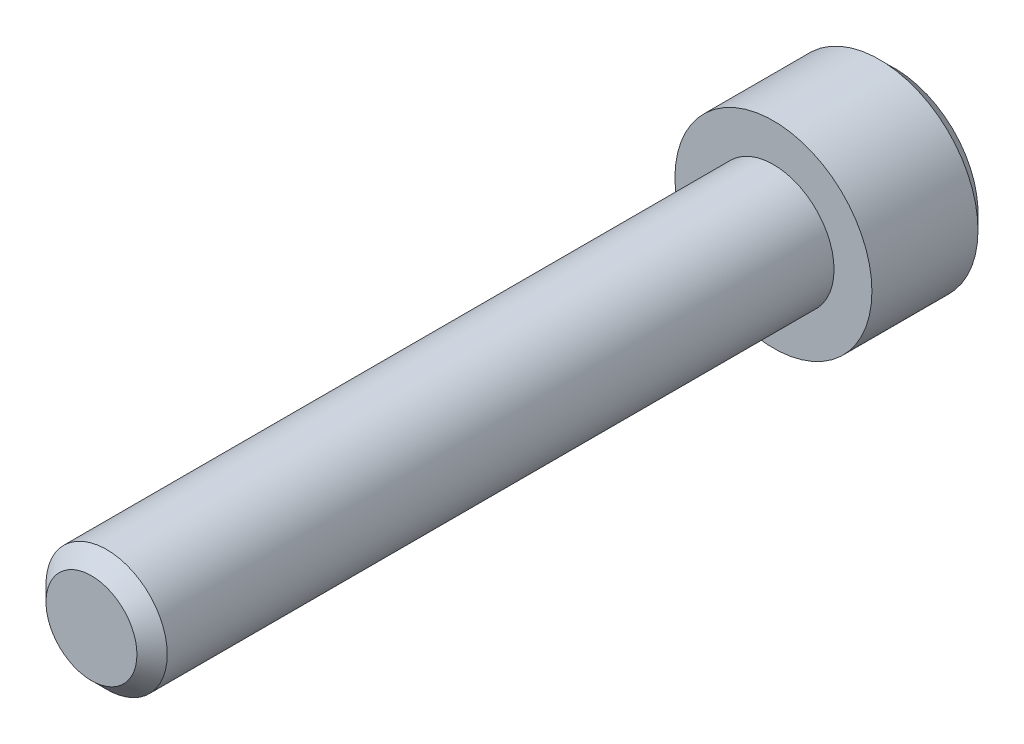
ISO-10303-21;
HEADER;
FILE_DESCRIPTION(('STEP AP214'),'2;1');
FILE_NAME('part.step','',(''),(''),'','','');
FILE_SCHEMA(('AUTOMOTIVE_DESIGN { 1 0 10303 214 1 1 1 1 }'));
ENDSEC;
DATA;
#1=APPLICATION_CONTEXT('core data for automotive mechanical design processes');
#2=APPLICATION_PROTOCOL_DEFINITION('international standard','automotive_design',2000,#1);
#3=PRODUCT_CONTEXT('',#1,'mechanical');
#4=PRODUCT('Part','Part','',(#3));
#5=PRODUCT_RELATED_PRODUCT_CATEGORY('part','',(#4));
#6=PRODUCT_DEFINITION_FORMATION('','',#4);
#7=PRODUCT_DEFINITION_CONTEXT('part definition',#1,'design');
#8=PRODUCT_DEFINITION('design','',#6,#7);
#9=PRODUCT_DEFINITION_SHAPE('','',#8);
#10=(LENGTH_UNIT() NAMED_UNIT(*) SI_UNIT(.MILLI.,.METRE.));
#11=(NAMED_UNIT(*) PLANE_ANGLE_UNIT() SI_UNIT($,.RADIAN.));
#12=(NAMED_UNIT(*) SI_UNIT($,.STERADIAN.) SOLID_ANGLE_UNIT());
#13=UNCERTAINTY_MEASURE_WITH_UNIT(LENGTH_MEASURE(1.E-05),#10,'distance_accuracy_value','');
#14=(GEOMETRIC_REPRESENTATION_CONTEXT(3) GLOBAL_UNCERTAINTY_ASSIGNED_CONTEXT((#13)) GLOBAL_UNIT_ASSIGNED_CONTEXT((#10,
#11,#12)) REPRESENTATION_CONTEXT('',''));
#15=CARTESIAN_POINT('',(0.,0.,0.));
#16=DIRECTION('',(0.,0.,1.));
#17=DIRECTION('',(1.,0.,0.));
#18=AXIS2_PLACEMENT_3D('',#15,#16,#17);
#19=CARTESIAN_POINT('',(-76.5011919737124,51.0956836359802,-91.));
#20=DIRECTION('',(0.,0.,-1.));
#21=DIRECTION('',(-1.,0.,0.));
#22=AXIS2_PLACEMENT_3D('',#19,#20,#21);
#23=PLANE('',#22);
#24=DIRECTION('',(-1.,0.,0.));
#25=VECTOR('',#24,1.);
#26=CARTESIAN_POINT('',(-74.7691411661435,48.0956836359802,-91.));
#27=LINE('',#26,#25);
#28=CARTESIAN_POINT('',(-74.7691411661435,48.0956836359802,-91.));
#29=VERTEX_POINT('',#28);
#30=CARTESIAN_POINT('',(-78.2332427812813,48.0956836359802,-91.));
#31=VERTEX_POINT('',#30);
#32=EDGE_CURVE('E301',#29,#31,#27,.T.);
#33=ORIENTED_EDGE('',*,*,#32,.F.);
#34=DIRECTION('',(-0.5,-0.866025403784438,0.));
#35=VECTOR('',#34,1.);
#36=CARTESIAN_POINT('',(-73.0370903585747,51.0956836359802,-91.));
#37=LINE('',#36,#35);
#38=CARTESIAN_POINT('',(-73.0370903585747,51.0956836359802,-91.));
#39=VERTEX_POINT('',#38);
#40=EDGE_CURVE('E88',#39,#29,#37,.T.);
#41=ORIENTED_EDGE('',*,*,#40,.F.);
#42=DIRECTION('',(0.5,-0.866025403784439,0.));
#43=VECTOR('',#42,1.);
#44=CARTESIAN_POINT('',(-74.7691411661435,54.0956836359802,-91.));
#45=LINE('',#44,#43);
#46=CARTESIAN_POINT('',(-74.7691411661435,54.0956836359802,-91.));
#47=VERTEX_POINT('',#46);
#48=EDGE_CURVE('E31',#47,#39,#45,.T.);
#49=ORIENTED_EDGE('',*,*,#48,.F.);
#50=DIRECTION('',(1.,0.,0.));
#51=VECTOR('',#50,1.);
#52=CARTESIAN_POINT('',(-78.2332427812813,54.0956836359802,-91.));
#53=LINE('',#52,#51);
#54=CARTESIAN_POINT('',(-78.2332427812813,54.0956836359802,-91.));
#55=VERTEX_POINT('',#54);
#56=EDGE_CURVE('E66',#55,#47,#53,.T.);
#57=ORIENTED_EDGE('',*,*,#56,.F.);
#58=DIRECTION('',(0.5,0.866025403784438,0.));
#59=VECTOR('',#58,1.);
#60=CARTESIAN_POINT('',(-79.9652935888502,51.0956836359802,-91.));
#61=LINE('',#60,#59);
#62=CARTESIAN_POINT('',(-79.9652935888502,51.0956836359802,-91.));
#63=VERTEX_POINT('',#62);
#64=EDGE_CURVE('E76',#63,#55,#61,.T.);
#65=ORIENTED_EDGE('',*,*,#64,.F.);
#66=DIRECTION('',(-0.5,0.86602540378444,0.));
#67=VECTOR('',#66,1.);
#68=CARTESIAN_POINT('',(-78.2332427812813,48.0956836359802,-91.));
#69=LINE('',#68,#67);
#70=EDGE_CURVE('E82',#31,#63,#69,.T.);
#71=ORIENTED_EDGE('',*,*,#70,.F.);
#72=EDGE_LOOP('',(#33,#41,#49,#57,#65,#71));
#73=FACE_BOUND('',#72,.T.);
#74=CARTESIAN_POINT('',(-76.5011919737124,51.0956836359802,-91.));
#75=DIRECTION('',(0.,0.,-1.));
#76=DIRECTION('',(-1.,0.,0.));
#77=AXIS2_PLACEMENT_3D('',#74,#75,#76);
#78=CIRCLE('',#77,5.5);
#79=CARTESIAN_POINT('',(-82.0011919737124,51.0956836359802,-91.));
#80=VERTEX_POINT('',#79);
#81=EDGE_CURVE('E110',#80,#80,#78,.T.);
#82=ORIENTED_EDGE('',*,*,#81,.T.);
#83=EDGE_LOOP('',(#82));
#84=FACE_BOUND('',#83,.T.);
#85=ADVANCED_FACE('F16',(#73,#84),#23,.T.);
#86=CARTESIAN_POINT('',(-76.5011919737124,51.0956836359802,-83.));
#87=DIRECTION('',(0.,0.,1.));
#88=DIRECTION('',(1.,0.,0.));
#89=AXIS2_PLACEMENT_3D('',#86,#87,#88);
#90=PLANE('',#89);
#91=CARTESIAN_POINT('',(-76.5011919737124,51.0956836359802,-83.));
#92=DIRECTION('',(0.,0.,1.));
#93=DIRECTION('',(1.,0.,0.));
#94=AXIS2_PLACEMENT_3D('',#91,#92,#93);
#95=CIRCLE('',#94,4.);
#96=CARTESIAN_POINT('',(-72.5011919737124,51.0956836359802,-83.));
#97=VERTEX_POINT('',#96);
#98=EDGE_CURVE('E113',#97,#97,#95,.T.);
#99=ORIENTED_EDGE('',*,*,#98,.F.);
#100=EDGE_LOOP('',(#99));
#101=FACE_BOUND('',#100,.T.);
#102=CARTESIAN_POINT('',(-76.5011919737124,51.0956836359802,-83.));
#103=DIRECTION('',(0.,0.,-1.));
#104=DIRECTION('',(-1.,0.,0.));
#105=AXIS2_PLACEMENT_3D('',#102,#103,#104);
#106=CIRCLE('',#105,6.5);
#107=CARTESIAN_POINT('',(-83.0011919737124,51.0956836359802,-83.));
#108=VERTEX_POINT('',#107);
#109=EDGE_CURVE('E102',#108,#108,#106,.T.);
#110=ORIENTED_EDGE('',*,*,#109,.F.);
#111=EDGE_LOOP('',(#110));
#112=FACE_BOUND('',#111,.T.);
#113=ADVANCED_FACE('F133',(#101,#112),#90,.T.);
#114=CARTESIAN_POINT('',(-76.5011919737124,51.0956836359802,-83.));
#115=DIRECTION('',(0.,0.,-1.));
#116=DIRECTION('',(-1.,0.,0.));
#117=AXIS2_PLACEMENT_3D('',#114,#115,#116);
#118=CYLINDRICAL_SURFACE('',#117,6.5);
#119=CARTESIAN_POINT('',(-76.5011919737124,51.0956836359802,-90.));
#120=DIRECTION('',(0.,0.,-1.));
#121=DIRECTION('',(-1.,0.,0.));
#122=AXIS2_PLACEMENT_3D('',#119,#120,#121);
#123=CIRCLE('',#122,6.5);
#124=CARTESIAN_POINT('',(-83.0011919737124,51.0956836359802,-90.));
#125=VERTEX_POINT('',#124);
#126=EDGE_CURVE('E107',#125,#125,#123,.F.);
#127=ORIENTED_EDGE('',*,*,#126,.T.);
#128=EDGE_LOOP('',(#127));
#129=FACE_BOUND('',#128,.T.);
#130=ORIENTED_EDGE('',*,*,#109,.T.);
#131=EDGE_LOOP('',(#130));
#132=FACE_BOUND('',#131,.T.);
#133=ADVANCED_FACE('F138',(#129,#132),#118,.T.);
#134=CARTESIAN_POINT('',(-76.5011919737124,51.0956836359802,-90.));
#135=DIRECTION('',(0.,0.,1.));
#136=DIRECTION('',(1.,0.,0.));
#137=AXIS2_PLACEMENT_3D('',#134,#135,#136);
#138=CONICAL_SURFACE('',#137,6.5,0.785398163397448);
#139=ORIENTED_EDGE('',*,*,#81,.F.);
#140=EDGE_LOOP('',(#139));
#141=FACE_BOUND('',#140,.T.);
#142=ORIENTED_EDGE('',*,*,#126,.F.);
#143=EDGE_LOOP('',(#142));
#144=FACE_BOUND('',#143,.T.);
#145=ADVANCED_FACE('F144',(#141,#144),#138,.T.);
#146=CARTESIAN_POINT('',(-74.7691411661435,48.0956836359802,-87.));
#147=DIRECTION('',(0.,-1.,0.));
#148=DIRECTION('',(1.,0.,0.));
#149=AXIS2_PLACEMENT_3D('',#146,#147,#148);
#150=PLANE('',#149);
#151=ORIENTED_EDGE('',*,*,#32,.T.);
#152=DIRECTION('',(0.,0.,-1.));
#153=VECTOR('',#152,1.);
#154=CARTESIAN_POINT('',(-78.2332427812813,48.0956836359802,-87.));
#155=LINE('',#154,#153);
#156=CARTESIAN_POINT('',(-78.2332427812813,48.0956836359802,-87.));
#157=VERTEX_POINT('',#156);
#158=EDGE_CURVE('E100',#157,#31,#155,.T.);
#159=ORIENTED_EDGE('',*,*,#158,.F.);
#160=DIRECTION('',(-1.,0.,0.));
#161=VECTOR('',#160,1.);
#162=CARTESIAN_POINT('',(-74.7691411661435,48.0956836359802,-87.));
#163=LINE('',#162,#161);
#164=CARTESIAN_POINT('',(-74.7691411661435,48.0956836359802,-87.));
#165=VERTEX_POINT('',#164);
#166=EDGE_CURVE('E94',#165,#157,#163,.T.);
#167=ORIENTED_EDGE('',*,*,#166,.F.);
#168=DIRECTION('',(0.,0.,-1.));
#169=VECTOR('',#168,1.);
#170=CARTESIAN_POINT('',(-74.7691411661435,48.0956836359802,-87.));
#171=LINE('',#170,#169);
#172=EDGE_CURVE('E97',#165,#29,#171,.T.);
#173=ORIENTED_EDGE('',*,*,#172,.T.);
#174=EDGE_LOOP('',(#151,#159,#167,#173));
#175=FACE_BOUND('',#174,.T.);
#176=ADVANCED_FACE('F147',(#175),#150,.F.);
#177=CARTESIAN_POINT('',(-78.2332427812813,48.0956836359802,-87.));
#178=DIRECTION('',(-0.86602540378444,-0.5,0.));
#179=DIRECTION('',(0.5,-0.86602540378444,0.));
#180=AXIS2_PLACEMENT_3D('',#177,#178,#179);
#181=PLANE('',#180);
#182=ORIENTED_EDGE('',*,*,#70,.T.);
#183=DIRECTION('',(0.,0.,-1.));
#184=VECTOR('',#183,1.);
#185=CARTESIAN_POINT('',(-79.9652935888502,51.0956836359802,-87.));
#186=LINE('',#185,#184);
#187=CARTESIAN_POINT('',(-79.9652935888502,51.0956836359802,-87.));
#188=VERTEX_POINT('',#187);
#189=EDGE_CURVE('E72',#188,#63,#186,.T.);
#190=ORIENTED_EDGE('',*,*,#189,.F.);
#191=DIRECTION('',(-0.5,0.86602540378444,0.));
#192=VECTOR('',#191,1.);
#193=CARTESIAN_POINT('',(-78.2332427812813,48.0956836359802,-87.));
#194=LINE('',#193,#192);
#195=EDGE_CURVE('E298',#157,#188,#194,.T.);
#196=ORIENTED_EDGE('',*,*,#195,.F.);
#197=ORIENTED_EDGE('',*,*,#158,.T.);
#198=EDGE_LOOP('',(#182,#190,#196,#197));
#199=FACE_BOUND('',#198,.T.);
#200=ADVANCED_FACE('F152',(#199),#181,.F.);
#201=CARTESIAN_POINT('',(-79.9652935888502,51.0956836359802,-87.));
#202=DIRECTION('',(-0.866025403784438,0.5,0.));
#203=DIRECTION('',(-0.5,-0.866025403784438,0.));
#204=AXIS2_PLACEMENT_3D('',#201,#202,#203);
#205=PLANE('',#204);
#206=ORIENTED_EDGE('',*,*,#64,.T.);
#207=DIRECTION('',(0.,0.,-1.));
#208=VECTOR('',#207,1.);
#209=CARTESIAN_POINT('',(-78.2332427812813,54.0956836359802,-87.));
#210=LINE('',#209,#208);
#211=CARTESIAN_POINT('',(-78.2332427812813,54.0956836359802,-87.));
#212=VERTEX_POINT('',#211);
#213=EDGE_CURVE('E61',#212,#55,#210,.T.);
#214=ORIENTED_EDGE('',*,*,#213,.F.);
#215=DIRECTION('',(0.5,0.866025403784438,0.));
#216=VECTOR('',#215,1.);
#217=CARTESIAN_POINT('',(-79.9652935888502,51.0956836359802,-87.));
#218=LINE('',#217,#216);
#219=EDGE_CURVE('E304',#188,#212,#218,.T.);
#220=ORIENTED_EDGE('',*,*,#219,.F.);
#221=ORIENTED_EDGE('',*,*,#189,.T.);
#222=EDGE_LOOP('',(#206,#214,#220,#221));
#223=FACE_BOUND('',#222,.T.);
#224=ADVANCED_FACE('F77',(#223),#205,.F.);
#225=CARTESIAN_POINT('',(-78.2332427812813,54.0956836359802,-87.));
#226=DIRECTION('',(0.,1.,0.));
#227=DIRECTION('',(-1.,0.,0.));
#228=AXIS2_PLACEMENT_3D('',#225,#226,#227);
#229=PLANE('',#228);
#230=ORIENTED_EDGE('',*,*,#56,.T.);
#231=DIRECTION('',(0.,0.,-1.));
#232=VECTOR('',#231,1.);
#233=CARTESIAN_POINT('',(-74.7691411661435,54.0956836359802,-87.));
#234=LINE('',#233,#232);
#235=CARTESIAN_POINT('',(-74.7691411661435,54.0956836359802,-87.));
#236=VERTEX_POINT('',#235);
#237=EDGE_CURVE('E73',#236,#47,#234,.T.);
#238=ORIENTED_EDGE('',*,*,#237,.F.);
#239=DIRECTION('',(1.,0.,0.));
#240=VECTOR('',#239,1.);
#241=CARTESIAN_POINT('',(-78.2332427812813,54.0956836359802,-87.));
#242=LINE('',#241,#240);
#243=EDGE_CURVE('E69',#212,#236,#242,.T.);
#244=ORIENTED_EDGE('',*,*,#243,.F.);
#245=ORIENTED_EDGE('',*,*,#213,.T.);
#246=EDGE_LOOP('',(#230,#238,#244,#245));
#247=FACE_BOUND('',#246,.T.);
#248=ADVANCED_FACE('F63',(#247),#229,.F.);
#249=CARTESIAN_POINT('',(-74.7691411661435,54.0956836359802,-87.));
#250=DIRECTION('',(0.866025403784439,0.5,0.));
#251=DIRECTION('',(-0.5,0.866025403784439,0.));
#252=AXIS2_PLACEMENT_3D('',#249,#250,#251);
#253=PLANE('',#252);
#254=ORIENTED_EDGE('',*,*,#48,.T.);
#255=DIRECTION('',(0.,0.,-1.));
#256=VECTOR('',#255,1.);
#257=CARTESIAN_POINT('',(-73.0370903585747,51.0956836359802,-87.));
#258=LINE('',#257,#256);
#259=CARTESIAN_POINT('',(-73.0370903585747,51.0956836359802,-87.));
#260=VERTEX_POINT('',#259);
#261=EDGE_CURVE('E95',#260,#39,#258,.T.);
#262=ORIENTED_EDGE('',*,*,#261,.F.);
#263=DIRECTION('',(0.5,-0.866025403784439,0.));
#264=VECTOR('',#263,1.);
#265=CARTESIAN_POINT('',(-74.7691411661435,54.0956836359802,-87.));
#266=LINE('',#265,#264);
#267=EDGE_CURVE('E40',#236,#260,#266,.T.);
#268=ORIENTED_EDGE('',*,*,#267,.F.);
#269=ORIENTED_EDGE('',*,*,#237,.T.);
#270=EDGE_LOOP('',(#254,#262,#268,#269));
#271=FACE_BOUND('',#270,.T.);
#272=ADVANCED_FACE('F171',(#271),#253,.F.);
#273=CARTESIAN_POINT('',(-73.0370903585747,51.0956836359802,-87.));
#274=DIRECTION('',(0.866025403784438,-0.5,0.));
#275=DIRECTION('',(0.5,0.866025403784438,0.));
#276=AXIS2_PLACEMENT_3D('',#273,#274,#275);
#277=PLANE('',#276);
#278=ORIENTED_EDGE('',*,*,#40,.T.);
#279=ORIENTED_EDGE('',*,*,#172,.F.);
#280=DIRECTION('',(-0.5,-0.866025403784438,0.));
#281=VECTOR('',#280,1.);
#282=CARTESIAN_POINT('',(-73.0370903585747,51.0956836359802,-87.));
#283=LINE('',#282,#281);
#284=EDGE_CURVE('E104',#260,#165,#283,.T.);
#285=ORIENTED_EDGE('',*,*,#284,.F.);
#286=ORIENTED_EDGE('',*,*,#261,.T.);
#287=EDGE_LOOP('',(#278,#279,#285,#286));
#288=FACE_BOUND('',#287,.T.);
#289=ADVANCED_FACE('F174',(#288),#277,.F.);
#290=CARTESIAN_POINT('',(-74.7691411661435,48.0956836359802,-87.));
#291=DIRECTION('',(0.,-0.5,0.866025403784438));
#292=DIRECTION('',(0.,-0.866025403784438,-0.5));
#293=AXIS2_PLACEMENT_3D('',#290,#291,#292);
#294=PLANE('',#293);
#295=ORIENTED_EDGE('',*,*,#166,.T.);
#296=DIRECTION('',(-0.44721359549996,-0.774596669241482,-0.447213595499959));
#297=VECTOR('',#296,1.);
#298=CARTESIAN_POINT('',(-77.5404224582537,49.2956836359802,-86.3071796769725));
#299=LINE('',#298,#297);
#300=CARTESIAN_POINT('',(-76.5011919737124,51.0956836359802,-85.2679491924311));
#301=VERTEX_POINT('',#300);
#302=EDGE_CURVE('E291',#301,#157,#299,.T.);
#303=ORIENTED_EDGE('',*,*,#302,.F.);
#304=DIRECTION('',(0.447213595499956,-0.774596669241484,-0.447213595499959));
#305=VECTOR('',#304,1.);
#306=CARTESIAN_POINT('',(-75.4619614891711,49.2956836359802,-86.3071796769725));
#307=LINE('',#306,#305);
#308=EDGE_CURVE('E294',#301,#165,#307,.T.);
#309=ORIENTED_EDGE('',*,*,#308,.T.);
#310=EDGE_LOOP('',(#295,#303,#309));
#311=FACE_BOUND('',#310,.T.);
#312=ADVANCED_FACE('F177',(#311),#294,.F.);
#313=CARTESIAN_POINT('',(-78.2332427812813,48.0956836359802,-87.));
#314=DIRECTION('',(-0.433012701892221,-0.25,0.866025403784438));
#315=DIRECTION('',(0.894427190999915,0.,0.447213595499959));
#316=AXIS2_PLACEMENT_3D('',#313,#314,#315);
#317=PLANE('',#316);
#318=ORIENTED_EDGE('',*,*,#195,.T.);
#319=DIRECTION('',(-0.894427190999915,0.,-0.447213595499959));
#320=VECTOR('',#319,1.);
#321=CARTESIAN_POINT('',(-78.5796529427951,51.0956836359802,-86.3071796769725));
#322=LINE('',#321,#320);
#323=EDGE_CURVE('E324',#301,#188,#322,.T.);
#324=ORIENTED_EDGE('',*,*,#323,.F.);
#325=ORIENTED_EDGE('',*,*,#302,.T.);
#326=EDGE_LOOP('',(#318,#324,#325));
#327=FACE_BOUND('',#326,.T.);
#328=ADVANCED_FACE('F193',(#327),#317,.F.);
#329=CARTESIAN_POINT('',(-79.9652935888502,51.0956836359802,-87.));
#330=DIRECTION('',(-0.43301270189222,0.25,0.866025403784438));
#331=DIRECTION('',(0.894427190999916,0.,0.447213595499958));
#332=AXIS2_PLACEMENT_3D('',#329,#330,#331);
#333=PLANE('',#332);
#334=ORIENTED_EDGE('',*,*,#219,.T.);
#335=DIRECTION('',(-0.447213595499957,0.774596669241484,-0.447213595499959));
#336=VECTOR('',#335,1.);
#337=CARTESIAN_POINT('',(-77.5404224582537,52.8956836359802,-86.3071796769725));
#338=LINE('',#337,#336);
#339=EDGE_CURVE('E325',#301,#212,#338,.T.);
#340=ORIENTED_EDGE('',*,*,#339,.F.);
#341=ORIENTED_EDGE('',*,*,#323,.T.);
#342=EDGE_LOOP('',(#334,#340,#341));
#343=FACE_BOUND('',#342,.T.);
#344=ADVANCED_FACE('F189',(#343),#333,.F.);
#345=CARTESIAN_POINT('',(-78.2332427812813,54.0956836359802,-87.));
#346=DIRECTION('',(0.,0.5,0.866025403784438));
#347=DIRECTION('',(0.,-0.866025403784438,0.5));
#348=AXIS2_PLACEMENT_3D('',#345,#346,#347);
#349=PLANE('',#348);
#350=ORIENTED_EDGE('',*,*,#243,.T.);
#351=DIRECTION('',(0.447213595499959,0.774596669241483,-0.447213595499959));
#352=VECTOR('',#351,1.);
#353=CARTESIAN_POINT('',(-75.4619614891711,52.8956836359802,-86.3071796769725));
#354=LINE('',#353,#352);
#355=EDGE_CURVE('E318',#301,#236,#354,.T.);
#356=ORIENTED_EDGE('',*,*,#355,.F.);
#357=ORIENTED_EDGE('',*,*,#339,.T.);
#358=EDGE_LOOP('',(#350,#356,#357));
#359=FACE_BOUND('',#358,.T.);
#360=ADVANCED_FACE('F186',(#359),#349,.F.);
#361=CARTESIAN_POINT('',(-74.7691411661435,54.0956836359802,-87.));
#362=DIRECTION('',(0.43301270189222,0.25,0.866025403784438));
#363=DIRECTION('',(0.894427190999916,0.,-0.447213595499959));
#364=AXIS2_PLACEMENT_3D('',#361,#362,#363);
#365=PLANE('',#364);
#366=ORIENTED_EDGE('',*,*,#267,.T.);
#367=DIRECTION('',(0.894427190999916,0.,-0.447213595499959));
#368=VECTOR('',#367,1.);
#369=CARTESIAN_POINT('',(-74.4227310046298,51.0956836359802,-86.3071796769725));
#370=LINE('',#369,#368);
#371=EDGE_CURVE('E331',#301,#260,#370,.T.);
#372=ORIENTED_EDGE('',*,*,#371,.F.);
#373=ORIENTED_EDGE('',*,*,#355,.T.);
#374=EDGE_LOOP('',(#366,#372,#373));
#375=FACE_BOUND('',#374,.T.);
#376=ADVANCED_FACE('F182',(#375),#365,.F.);
#377=CARTESIAN_POINT('',(-73.0370903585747,51.0956836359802,-87.));
#378=DIRECTION('',(0.43301270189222,-0.25,0.866025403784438));
#379=DIRECTION('',(0.894427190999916,0.,-0.447213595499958));
#380=AXIS2_PLACEMENT_3D('',#377,#378,#379);
#381=PLANE('',#380);
#382=ORIENTED_EDGE('',*,*,#284,.T.);
#383=ORIENTED_EDGE('',*,*,#308,.F.);
#384=ORIENTED_EDGE('',*,*,#371,.T.);
#385=EDGE_LOOP('',(#382,#383,#384));
#386=FACE_BOUND('',#385,.T.);
#387=ADVANCED_FACE('F179',(#386),#381,.F.);
#388=CARTESIAN_POINT('',(-76.5011919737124,51.0956836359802,-53.));
#389=DIRECTION('',(0.,0.,-1.));
#390=DIRECTION('',(-1.,0.,0.));
#391=AXIS2_PLACEMENT_3D('',#388,#389,#390);
#392=CYLINDRICAL_SURFACE('',#391,4.);
#393=CARTESIAN_POINT('',(-76.5011919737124,51.0956836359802,-39.));
#394=DIRECTION('',(0.,0.,1.));
#395=DIRECTION('',(1.,0.,0.));
#396=AXIS2_PLACEMENT_3D('',#393,#394,#395);
#397=CIRCLE('',#396,4.);
#398=CARTESIAN_POINT('',(-72.5011919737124,51.0956836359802,-39.));
#399=VERTEX_POINT('',#398);
#400=EDGE_CURVE('E20',#399,#399,#397,.F.);
#401=ORIENTED_EDGE('',*,*,#400,.T.);
#402=EDGE_LOOP('',(#401));
#403=FACE_BOUND('',#402,.T.);
#404=ORIENTED_EDGE('',*,*,#98,.T.);
#405=EDGE_LOOP('',(#404));
#406=FACE_BOUND('',#405,.T.);
#407=ADVANCED_FACE('F120',(#403,#406),#392,.T.);
#408=CARTESIAN_POINT('',(-76.5011919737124,51.0956836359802,-38.));
#409=DIRECTION('',(0.,0.,1.));
#410=DIRECTION('',(1.,0.,0.));
#411=AXIS2_PLACEMENT_3D('',#408,#409,#410);
#412=PLANE('',#411);
#413=CARTESIAN_POINT('',(-76.5011919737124,51.0956836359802,-38.));
#414=DIRECTION('',(0.,0.,1.));
#415=DIRECTION('',(1.,0.,0.));
#416=AXIS2_PLACEMENT_3D('',#413,#414,#415);
#417=CIRCLE('',#416,3.);
#418=CARTESIAN_POINT('',(-73.5011919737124,51.0956836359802,-38.));
#419=VERTEX_POINT('',#418);
#420=EDGE_CURVE('E11',#419,#419,#417,.T.);
#421=ORIENTED_EDGE('',*,*,#420,.T.);
#422=EDGE_LOOP('',(#421));
#423=FACE_BOUND('',#422,.T.);
#424=ADVANCED_FACE('F18',(#423),#412,.T.);
#425=CARTESIAN_POINT('',(-76.5011919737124,51.0956836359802,-39.));
#426=DIRECTION('',(0.,0.,-1.));
#427=DIRECTION('',(-1.,0.,0.));
#428=AXIS2_PLACEMENT_3D('',#425,#426,#427);
#429=CONICAL_SURFACE('',#428,4.,0.785398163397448);
#430=ORIENTED_EDGE('',*,*,#420,.F.);
#431=EDGE_LOOP('',(#430));
#432=FACE_BOUND('',#431,.T.);
#433=ORIENTED_EDGE('',*,*,#400,.F.);
#434=EDGE_LOOP('',(#433));
#435=FACE_BOUND('',#434,.T.);
#436=ADVANCED_FACE('F122',(#432,#435),#429,.T.);
#437=CLOSED_SHELL('',(#85,#113,#133,#145,#176,#200,#224,#248,#272,#289,#312,#328,#344,#360,#376,
#387,#407,#424,#436));
#438=MANIFOLD_SOLID_BREP('B1',#437);
#439=ADVANCED_BREP_SHAPE_REPRESENTATION('',(#18,#438),#14);
#440=SHAPE_DEFINITION_REPRESENTATION(#9,#439);
ENDSEC;
END-ISO-10303-21;
